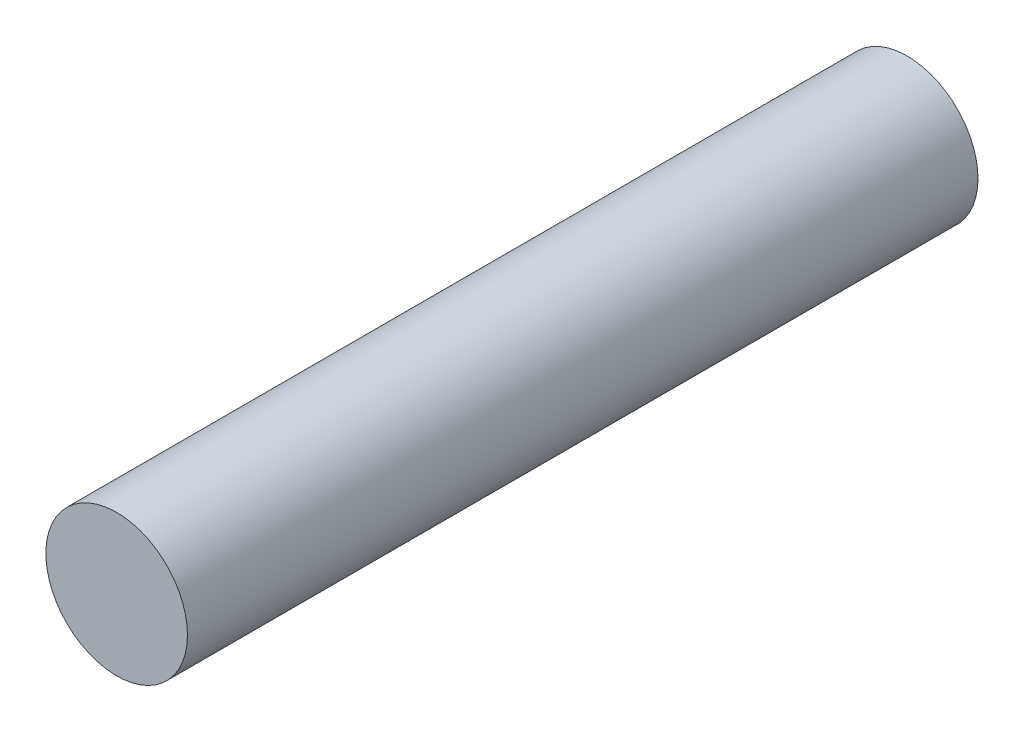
ISO-10303-21;
HEADER;
FILE_DESCRIPTION(('STEP AP214'),'2;1');
FILE_NAME('part.step','',(''),(''),'','','');
FILE_SCHEMA(('AUTOMOTIVE_DESIGN { 1 0 10303 214 1 1 1 1 }'));
ENDSEC;
DATA;
#1=APPLICATION_CONTEXT('core data for automotive mechanical design processes');
#2=APPLICATION_PROTOCOL_DEFINITION('international standard','automotive_design',2000,#1);
#3=PRODUCT_CONTEXT('',#1,'mechanical');
#4=PRODUCT('Part','Part','',(#3));
#5=PRODUCT_RELATED_PRODUCT_CATEGORY('part','',(#4));
#6=PRODUCT_DEFINITION_FORMATION('','',#4);
#7=PRODUCT_DEFINITION_CONTEXT('part definition',#1,'design');
#8=PRODUCT_DEFINITION('design','',#6,#7);
#9=PRODUCT_DEFINITION_SHAPE('','',#8);
#10=(LENGTH_UNIT() NAMED_UNIT(*) SI_UNIT(.MILLI.,.METRE.));
#11=(NAMED_UNIT(*) PLANE_ANGLE_UNIT() SI_UNIT($,.RADIAN.));
#12=(NAMED_UNIT(*) SI_UNIT($,.STERADIAN.) SOLID_ANGLE_UNIT());
#13=UNCERTAINTY_MEASURE_WITH_UNIT(LENGTH_MEASURE(1.E-05),#10,'distance_accuracy_value','');
#14=(GEOMETRIC_REPRESENTATION_CONTEXT(3) GLOBAL_UNCERTAINTY_ASSIGNED_CONTEXT((#13)) GLOBAL_UNIT_ASSIGNED_CONTEXT((#10,
#11,#12)) REPRESENTATION_CONTEXT('',''));
#15=CARTESIAN_POINT('',(0.,0.,0.));
#16=DIRECTION('',(0.,0.,1.));
#17=DIRECTION('',(1.,0.,0.));
#18=AXIS2_PLACEMENT_3D('',#15,#16,#17);
#19=CARTESIAN_POINT('',(0.,0.,11.));
#20=DIRECTION('',(0.,0.,-1.));
#21=DIRECTION('',(-1.,0.,0.));
#22=AXIS2_PLACEMENT_3D('',#19,#20,#21);
#23=CYLINDRICAL_SURFACE('',#22,0.985);
#24=CARTESIAN_POINT('',(0.,0.,11.));
#25=DIRECTION('',(0.,0.,1.));
#26=DIRECTION('',(1.,0.,0.));
#27=AXIS2_PLACEMENT_3D('',#24,#25,#26);
#28=CIRCLE('',#27,0.985);
#29=CARTESIAN_POINT('',(0.985,0.,11.));
#30=VERTEX_POINT('',#29);
#31=EDGE_CURVE('E10',#30,#30,#28,.T.);
#32=ORIENTED_EDGE('',*,*,#31,.F.);
#33=EDGE_LOOP('',(#32));
#34=FACE_BOUND('',#33,.T.);
#35=CARTESIAN_POINT('',(0.,0.,0.));
#36=DIRECTION('',(0.,0.,1.));
#37=DIRECTION('',(1.,0.,0.));
#38=AXIS2_PLACEMENT_3D('',#35,#36,#37);
#39=CIRCLE('',#38,0.985);
#40=CARTESIAN_POINT('',(0.985,0.,0.));
#41=VERTEX_POINT('',#40);
#42=EDGE_CURVE('E46',#41,#41,#39,.T.);
#43=ORIENTED_EDGE('',*,*,#42,.T.);
#44=EDGE_LOOP('',(#43));
#45=FACE_BOUND('',#44,.T.);
#46=ADVANCED_FACE('F43',(#34,#45),#23,.T.);
#47=CARTESIAN_POINT('',(0.,0.,11.));
#48=DIRECTION('',(0.,0.,1.));
#49=DIRECTION('',(1.,0.,0.));
#50=AXIS2_PLACEMENT_3D('',#47,#48,#49);
#51=PLANE('',#50);
#52=ORIENTED_EDGE('',*,*,#31,.T.);
#53=EDGE_LOOP('',(#52));
#54=FACE_BOUND('',#53,.T.);
#55=ADVANCED_FACE('F60',(#54),#51,.T.);
#56=CARTESIAN_POINT('',(0.,0.,0.));
#57=DIRECTION('',(0.,0.,1.));
#58=DIRECTION('',(1.,0.,0.));
#59=AXIS2_PLACEMENT_3D('',#56,#57,#58);
#60=PLANE('',#59);
#61=ORIENTED_EDGE('',*,*,#42,.F.);
#62=EDGE_LOOP('',(#61));
#63=FACE_BOUND('',#62,.T.);
#64=ADVANCED_FACE('F58',(#63),#60,.F.);
#65=CLOSED_SHELL('',(#46,#55,#64));
#66=MANIFOLD_SOLID_BREP('B2',#65);
#67=ADVANCED_BREP_SHAPE_REPRESENTATION('',(#18,#66),#14);
#68=SHAPE_DEFINITION_REPRESENTATION(#9,#67);
ENDSEC;
END-ISO-10303-21;
